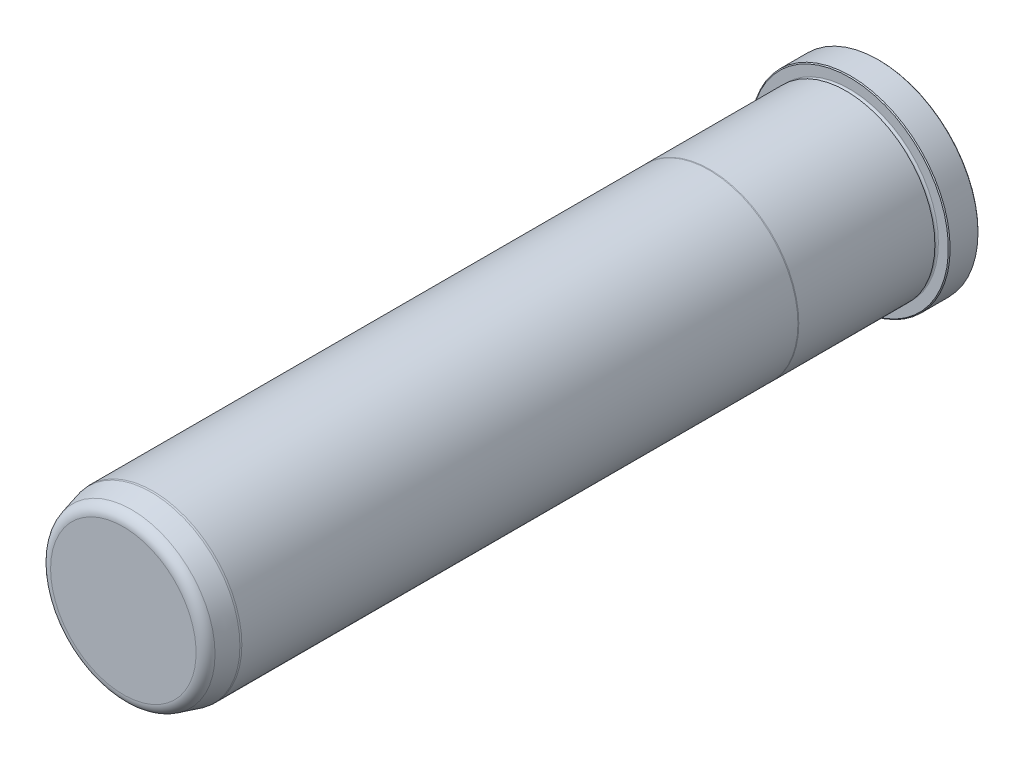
from build123d import *

# Parameters (mm, degrees)
FILLET6_R     = 4.7625
CHAMFER1_SIZE = 0.381


with BuildPart() as part:
    # Sketch1 → Revolve1 (revolve)
    with BuildSketch(Plane(origin=(0, 0, 0), x_dir=(0, 0, -1), z_dir=(1, 0, 0)), mode=Mode.PRIVATE) as revolve1_sk:
        with BuildLine():
            Line((0, 0), (0, 42.7355))
            Line((0, 42.7355), (-12.7, 42.7355))
            Line((-12.7, 42.7355), (-12.7, 38.0873))
            ThreePointArc((-12.7, 38.0873), (-13.462, 37.3253), (-14.224, 38.0873))
            Line((-14.224, 38.0873), (-14.224, 38.1127))
            Line((-14.224, 38.1127), (-72.534763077, 38.1127))
            Line((-72.534763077, 38.1127), (-72.898, 38.0873))
            Line((-72.898, 38.0873), (-311.15, 38.0873))
            Line((-311.15, 38.0873), (-311.912, 38.020633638))
            Line((-311.912, 38.020633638), (-323.85, 34.821856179))
            Line((-323.85, 34.821856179), (-323.85, 0))
            Line((-323.85, 0), (0, 0))
        make_face()
    revolve(revolve1_sk.sketch.rotate(Axis((0, 0, 0), (0, 0, -1)), 90), axis=Axis((0, 0, 0), (0, 0, -1)))

    # Fillet6
    fillet6_edges = [part.edges().sort_by_distance(p)[0] for p in [
        (-34.821856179, 0, 323.85),
    ]]
    fillet(fillet6_edges, radius=FILLET6_R)

    # Chamfer1
    chamfer1_edges = [part.edges().sort_by_distance(p)[0] for p in [
        (-42.7355, 0, 12.7),
        (-42.7355, 0, 0),
    ]]
    chamfer(chamfer1_edges, length=CHAMFER1_SIZE)


solid = part.part
